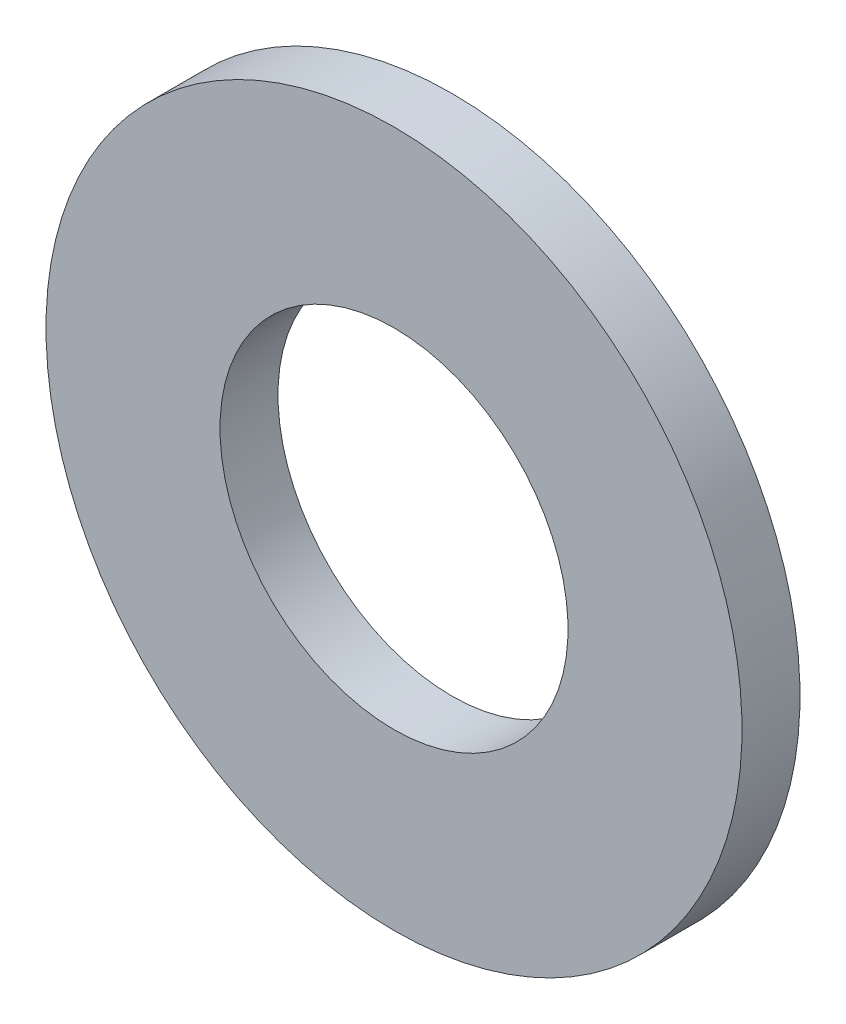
ISO-10303-21;
HEADER;
FILE_DESCRIPTION(('STEP AP214'),'2;1');
FILE_NAME('part.step','',(''),(''),'','','');
FILE_SCHEMA(('AUTOMOTIVE_DESIGN { 1 0 10303 214 1 1 1 1 }'));
ENDSEC;
DATA;
#1=APPLICATION_CONTEXT('core data for automotive mechanical design processes');
#2=APPLICATION_PROTOCOL_DEFINITION('international standard','automotive_design',2000,#1);
#3=PRODUCT_CONTEXT('',#1,'mechanical');
#4=PRODUCT('Part','Part','',(#3));
#5=PRODUCT_RELATED_PRODUCT_CATEGORY('part','',(#4));
#6=PRODUCT_DEFINITION_FORMATION('','',#4);
#7=PRODUCT_DEFINITION_CONTEXT('part definition',#1,'design');
#8=PRODUCT_DEFINITION('design','',#6,#7);
#9=PRODUCT_DEFINITION_SHAPE('','',#8);
#10=(LENGTH_UNIT() NAMED_UNIT(*) SI_UNIT(.MILLI.,.METRE.));
#11=(NAMED_UNIT(*) PLANE_ANGLE_UNIT() SI_UNIT($,.RADIAN.));
#12=(NAMED_UNIT(*) SI_UNIT($,.STERADIAN.) SOLID_ANGLE_UNIT());
#13=UNCERTAINTY_MEASURE_WITH_UNIT(LENGTH_MEASURE(1.E-05),#10,'distance_accuracy_value','');
#14=(GEOMETRIC_REPRESENTATION_CONTEXT(3) GLOBAL_UNCERTAINTY_ASSIGNED_CONTEXT((#13)) GLOBAL_UNIT_ASSIGNED_CONTEXT((#10,
#11,#12)) REPRESENTATION_CONTEXT('',''));
#15=CARTESIAN_POINT('',(0.,0.,0.));
#16=DIRECTION('',(0.,0.,1.));
#17=DIRECTION('',(1.,0.,0.));
#18=AXIS2_PLACEMENT_3D('',#15,#16,#17);
#19=CARTESIAN_POINT('',(0.,0.,0.));
#20=DIRECTION('',(0.,0.,1.));
#21=DIRECTION('',(0.,-1.,0.));
#22=AXIS2_PLACEMENT_3D('',#19,#20,#21);
#23=PLANE('',#22);
#24=CARTESIAN_POINT('',(0.,0.,0.));
#25=DIRECTION('',(0.,0.,-1.));
#26=DIRECTION('',(0.,1.,0.));
#27=AXIS2_PLACEMENT_3D('',#24,#25,#26);
#28=CIRCLE('',#27,3.);
#29=CARTESIAN_POINT('',(0.,3.,0.));
#30=VERTEX_POINT('',#29);
#31=EDGE_CURVE('E27',#30,#30,#28,.F.);
#32=ORIENTED_EDGE('',*,*,#31,.T.);
#33=EDGE_LOOP('',(#32));
#34=FACE_BOUND('',#33,.T.);
#35=CARTESIAN_POINT('',(0.,0.,0.));
#36=DIRECTION('',(0.,0.,-1.));
#37=DIRECTION('',(0.,1.,0.));
#38=AXIS2_PLACEMENT_3D('',#35,#36,#37);
#39=CIRCLE('',#38,6.00000000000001);
#40=CARTESIAN_POINT('',(0.,6.00000000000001,0.));
#41=VERTEX_POINT('',#40);
#42=EDGE_CURVE('E18',#41,#41,#39,.F.);
#43=ORIENTED_EDGE('',*,*,#42,.F.);
#44=EDGE_LOOP('',(#43));
#45=FACE_BOUND('',#44,.T.);
#46=ADVANCED_FACE('F15',(#34,#45),#23,.F.);
#47=CARTESIAN_POINT('',(0.,0.,1.));
#48=DIRECTION('',(0.,0.,-1.));
#49=DIRECTION('',(0.,1.,0.));
#50=AXIS2_PLACEMENT_3D('',#47,#48,#49);
#51=CYLINDRICAL_SURFACE('',#50,6.00000000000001);
#52=ORIENTED_EDGE('',*,*,#42,.T.);
#53=EDGE_LOOP('',(#52));
#54=FACE_BOUND('',#53,.T.);
#55=CARTESIAN_POINT('',(0.,0.,1.));
#56=DIRECTION('',(0.,0.,-1.));
#57=DIRECTION('',(0.,1.,0.));
#58=AXIS2_PLACEMENT_3D('',#55,#56,#57);
#59=CIRCLE('',#58,6.00000000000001);
#60=CARTESIAN_POINT('',(0.,6.00000000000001,1.));
#61=VERTEX_POINT('',#60);
#62=EDGE_CURVE('E22',#61,#61,#59,.F.);
#63=ORIENTED_EDGE('',*,*,#62,.F.);
#64=EDGE_LOOP('',(#63));
#65=FACE_BOUND('',#64,.T.);
#66=ADVANCED_FACE('F35',(#54,#65),#51,.T.);
#67=CARTESIAN_POINT('',(0.,0.,1.));
#68=DIRECTION('',(0.,0.,-1.));
#69=DIRECTION('',(0.,1.,0.));
#70=AXIS2_PLACEMENT_3D('',#67,#68,#69);
#71=CYLINDRICAL_SURFACE('',#70,3.);
#72=CARTESIAN_POINT('',(0.,0.,1.));
#73=DIRECTION('',(0.,0.,-1.));
#74=DIRECTION('',(0.,1.,0.));
#75=AXIS2_PLACEMENT_3D('',#72,#73,#74);
#76=CIRCLE('',#75,3.);
#77=CARTESIAN_POINT('',(0.,3.,1.));
#78=VERTEX_POINT('',#77);
#79=EDGE_CURVE('E10',#78,#78,#76,.T.);
#80=ORIENTED_EDGE('',*,*,#79,.F.);
#81=EDGE_LOOP('',(#80));
#82=FACE_BOUND('',#81,.T.);
#83=ORIENTED_EDGE('',*,*,#31,.F.);
#84=EDGE_LOOP('',(#83));
#85=FACE_BOUND('',#84,.T.);
#86=ADVANCED_FACE('F43',(#82,#85),#71,.F.);
#87=CARTESIAN_POINT('',(0.,0.,1.));
#88=DIRECTION('',(0.,0.,1.));
#89=DIRECTION('',(0.,-1.,0.));
#90=AXIS2_PLACEMENT_3D('',#87,#88,#89);
#91=PLANE('',#90);
#92=ORIENTED_EDGE('',*,*,#79,.T.);
#93=EDGE_LOOP('',(#92));
#94=FACE_BOUND('',#93,.T.);
#95=ORIENTED_EDGE('',*,*,#62,.T.);
#96=EDGE_LOOP('',(#95));
#97=FACE_BOUND('',#96,.T.);
#98=ADVANCED_FACE('F44',(#94,#97),#91,.T.);
#99=CLOSED_SHELL('',(#46,#66,#86,#98));
#100=MANIFOLD_SOLID_BREP('B1',#99);
#101=ADVANCED_BREP_SHAPE_REPRESENTATION('',(#18,#100),#14);
#102=SHAPE_DEFINITION_REPRESENTATION(#9,#101);
ENDSEC;
END-ISO-10303-21;
